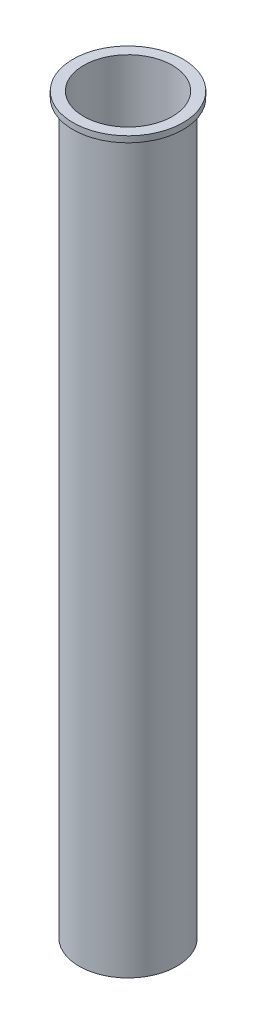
from build123d import *


with BuildPart() as part:
    # Sketch2 → Revolve8 (revolve)
    with BuildSketch(Plane(origin=(0, 0, 0), x_dir=(0, 0, -1), z_dir=(1, 0, 0))):
        with BuildLine():
            Line((92.075, 0), (114.3, 0))
            Line((114.3, 0), (114.3, -12.7))
            Line((114.3, -12.7), (101.6, -12.7))
            Line((101.6, -12.7), (101.6, -1524))
            Line((101.6, -1524), (96.523376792, -1524))
            add(Edge.make_bspline(
                [(12.7, -1460.5), (12.7, -1481.261348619), (25.102609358, -1525.214659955), (71.178500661, -1524), (96.523376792, -1524)],
                knots=[0, 0, 0, 0, 0.444656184, 1, 1, 1, 1], degree=3))
            Line((12.7, -1460.5), (12.7, -1447.8))
            Line((12.7, -1447.8), (92.075, -1447.8))
            Line((92.075, -1447.8), (92.075, 0))
        make_face()
    revolve(axis=Axis((0, 0, 0), (0, 1, 0)))


solid = part.part
